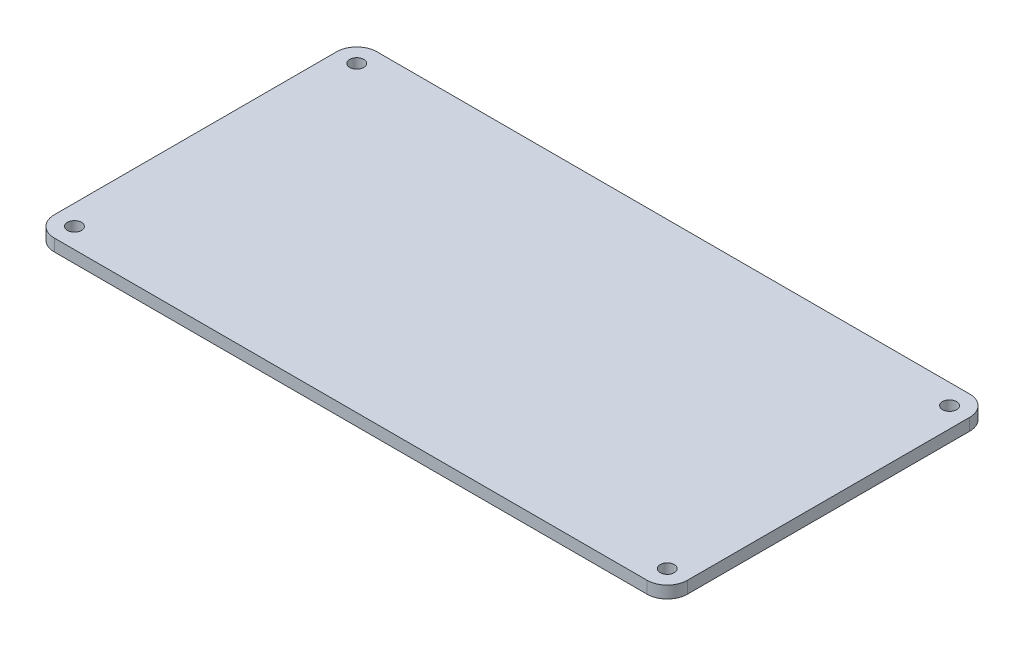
from build123d import *

# Parameters (mm, degrees)
BOSS_EXTRUDE1_DEPTH = 3
FILLET1_R           = 5
SKETCH2_R           = 1.75
CUT_EXTRUDE1_DEPTH  = 10


with BuildPart() as part:
    # Sketch1 → Boss-Extrude1 (new body)
    with BuildSketch(Plane(origin=(0, 0, 0), x_dir=(1, 0, 0), z_dir=(0, 1, 0))):
        Polygon((0, -30), (0, 30), (0, 40), (77, 40), (157, 40), (157, -40), (77, -40), (0, -40), align=None)
    extrude(amount=BOSS_EXTRUDE1_DEPTH)

    # Fillet1
    fillet1_edges = [part.edges().sort_by_distance(p)[0] for p in [
        (157, 1.5, 40),
        (0, 1.5, 40),
        (0, 1.5, -40),
        (157, 1.5, -40),
    ]]
    fillet(fillet1_edges, radius=FILLET1_R)

    # Sketch2 → Cut-Extrude1 (cut)
    with BuildSketch(Plane(origin=(0, 3, 0), x_dir=(1, 0, 0), z_dir=(0, 1, 0))):
        with Locations(Location((5, 35, 0), (0, 0, 270))):
            Circle(SKETCH2_R)
        with Locations(Location((152, 35, 0), (0, 0, 270))):
            Circle(SKETCH2_R)
        with Locations(Location((152, -35, 0), (0, 0, 270))):
            Circle(SKETCH2_R)
        with Locations(Location((5, -35, 0), (0, 0, 270))):
            Circle(SKETCH2_R)
    extrude(amount=-CUT_EXTRUDE1_DEPTH, mode=Mode.SUBTRACT)


solid = part.part
